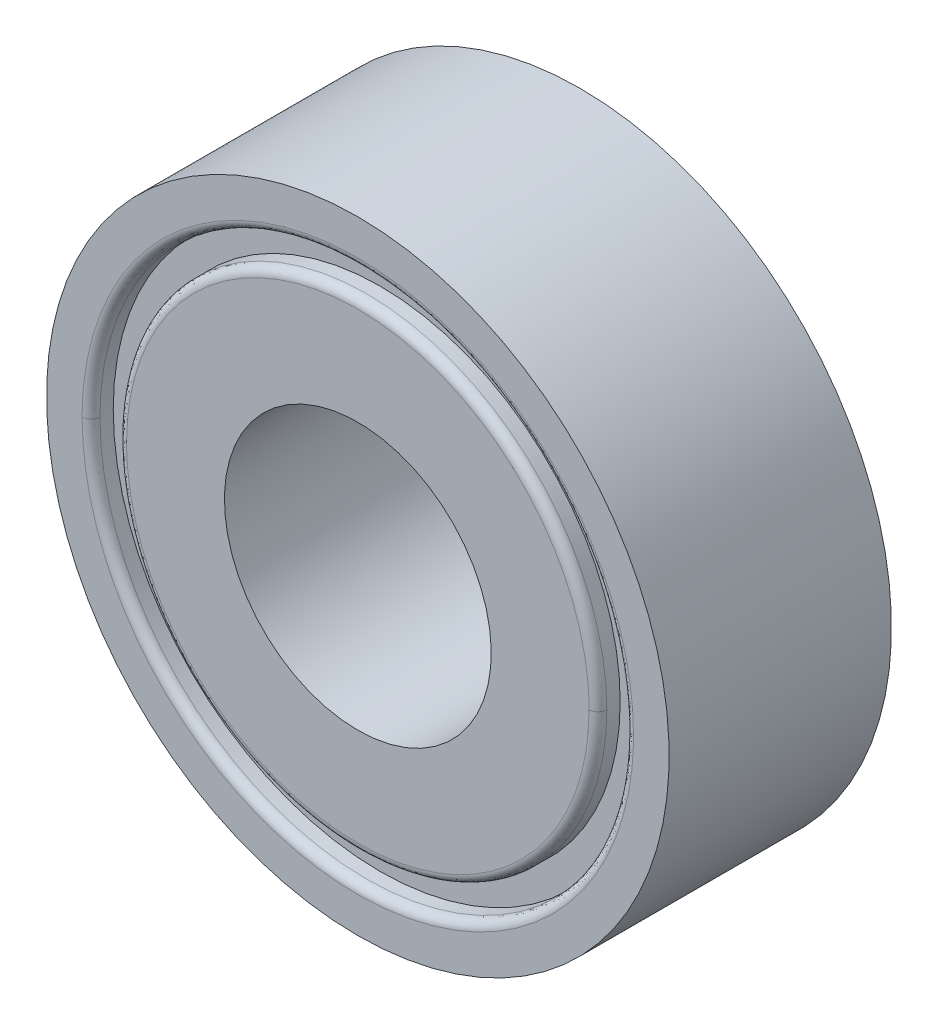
ISO-10303-21;
HEADER;
FILE_DESCRIPTION(('STEP AP214'),'2;1');
FILE_NAME('part.step','',(''),(''),'','','');
FILE_SCHEMA(('AUTOMOTIVE_DESIGN { 1 0 10303 214 1 1 1 1 }'));
ENDSEC;
DATA;
#1=APPLICATION_CONTEXT('core data for automotive mechanical design processes');
#2=APPLICATION_PROTOCOL_DEFINITION('international standard','automotive_design',2000,#1);
#3=PRODUCT_CONTEXT('',#1,'mechanical');
#4=PRODUCT('Part','Part','',(#3));
#5=PRODUCT_RELATED_PRODUCT_CATEGORY('part','',(#4));
#6=PRODUCT_DEFINITION_FORMATION('','',#4);
#7=PRODUCT_DEFINITION_CONTEXT('part definition',#1,'design');
#8=PRODUCT_DEFINITION('design','',#6,#7);
#9=PRODUCT_DEFINITION_SHAPE('','',#8);
#10=(LENGTH_UNIT() NAMED_UNIT(*) SI_UNIT(.MILLI.,.METRE.));
#11=(NAMED_UNIT(*) PLANE_ANGLE_UNIT() SI_UNIT($,.RADIAN.));
#12=(NAMED_UNIT(*) SI_UNIT($,.STERADIAN.) SOLID_ANGLE_UNIT());
#13=UNCERTAINTY_MEASURE_WITH_UNIT(LENGTH_MEASURE(1.E-05),#10,'distance_accuracy_value','');
#14=(GEOMETRIC_REPRESENTATION_CONTEXT(3) GLOBAL_UNCERTAINTY_ASSIGNED_CONTEXT((#13)) GLOBAL_UNIT_ASSIGNED_CONTEXT((#10,
#11,#12)) REPRESENTATION_CONTEXT('',''));
#15=CARTESIAN_POINT('',(0.,0.,0.));
#16=DIRECTION('',(0.,0.,1.));
#17=DIRECTION('',(1.,0.,0.));
#18=AXIS2_PLACEMENT_3D('',#15,#16,#17);
#19=CARTESIAN_POINT('',(-3.000499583,0.,8.890016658));
#20=CARTESIAN_POINT('',(-3.000499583,-6.000999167,8.890016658));
#21=CARTESIAN_POINT('',(3.000499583,-6.000999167,8.890016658));
#22=CARTESIAN_POINT('',(3.000499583,0.,8.890016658));
#23=CARTESIAN_POINT('',(-2.993677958,0.,8.958005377));
#24=CARTESIAN_POINT('',(-2.993677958,-5.987355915,8.958005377));
#25=CARTESIAN_POINT('',(2.993677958,-5.987355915,8.958005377));
#26=CARTESIAN_POINT('',(2.993677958,0.,8.958005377));
#27=CARTESIAN_POINT('',(-3.041994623,0.,9.006322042));
#28=CARTESIAN_POINT('',(-3.041994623,-6.083989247,9.006322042));
#29=CARTESIAN_POINT('',(3.041994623,-6.083989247,9.006322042));
#30=CARTESIAN_POINT('',(3.041994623,0.,9.006322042));
#31=CARTESIAN_POINT('',(-3.109983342,0.,8.999500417));
#32=CARTESIAN_POINT('',(-3.109983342,-6.219966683,8.999500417));
#33=CARTESIAN_POINT('',(3.109983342,-6.219966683,8.999500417));
#34=CARTESIAN_POINT('',(3.109983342,0.,8.999500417));
#35=(BOUNDED_SURFACE() B_SPLINE_SURFACE(3,3,((#19,#20,#21,#22),(#23,#24,#25,#26),(#27,#28,#29,
#30),(#31,#32,#33,#34)),.UNSPECIFIED.,.F.,.F.,.F.) B_SPLINE_SURFACE_WITH_KNOTS((4,4),(4,4),(0.,
1.),(0.,1.),.UNSPECIFIED.) GEOMETRIC_REPRESENTATION_ITEM() RATIONAL_B_SPLINE_SURFACE(((1.,
0.333333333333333,0.333333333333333,1.),(0.755320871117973,0.251773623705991,0.251773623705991,
0.755320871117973),(0.755320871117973,0.251773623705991,0.251773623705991,0.755320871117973),
(1.,0.333333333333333,0.333333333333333,1.))) REPRESENTATION_ITEM('') SURFACE());
#36=CARTESIAN_POINT('',(3.000499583,0.,8.890016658));
#37=CARTESIAN_POINT('',(2.993677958,0.,8.958005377));
#38=CARTESIAN_POINT('',(3.041994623,0.,9.006322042));
#39=CARTESIAN_POINT('',(3.109983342,0.,8.999500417));
#40=(BOUNDED_CURVE() B_SPLINE_CURVE(3,(#36,#37,#38,#39),.UNSPECIFIED.,.F.,
.F.) B_SPLINE_CURVE_WITH_KNOTS((4,4),(0.,1.),
.UNSPECIFIED.) CURVE() GEOMETRIC_REPRESENTATION_ITEM() RATIONAL_B_SPLINE_CURVE((1.,
0.755320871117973,0.755320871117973,1.)) REPRESENTATION_ITEM(''));
#41=CARTESIAN_POINT('',(2.99999999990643,-4.04071327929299E-10,8.89999999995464));
#42=VERTEX_POINT('',#41);
#43=CARTESIAN_POINT('',(3.09999999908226,0.,9.00000000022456));
#44=VERTEX_POINT('',#43);
#45=EDGE_CURVE('E92',#42,#44,#40,.T.);
#46=CARTESIAN_POINT('',(0.,0.,8.9));
#47=DIRECTION('',(0.,0.,1.));
#48=DIRECTION('',(1.,0.,0.));
#49=AXIS2_PLACEMENT_3D('',#46,#47,#48);
#50=CIRCLE('',#49,3.);
#51=CARTESIAN_POINT('',(-2.99999999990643,-9.2296542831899E-10,8.89999999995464));
#52=VERTEX_POINT('',#51);
#53=EDGE_CURVE('E97',#52,#42,#50,.T.);
#54=CARTESIAN_POINT('',(-3.000499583,0.,8.890016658));
#55=CARTESIAN_POINT('',(-2.993677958,0.,8.958005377));
#56=CARTESIAN_POINT('',(-3.041994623,0.,9.006322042));
#57=CARTESIAN_POINT('',(-3.109983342,0.,8.999500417));
#58=(BOUNDED_CURVE() B_SPLINE_CURVE(3,(#54,#55,#56,#57),.UNSPECIFIED.,.F.,
.F.) B_SPLINE_CURVE_WITH_KNOTS((4,4),(0.,1.),
.UNSPECIFIED.) CURVE() GEOMETRIC_REPRESENTATION_ITEM() RATIONAL_B_SPLINE_CURVE((1.,
0.755320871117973,0.755320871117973,1.)) REPRESENTATION_ITEM(''));
#59=CARTESIAN_POINT('',(-3.09999999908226,0.,9.00000000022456));
#60=VERTEX_POINT('',#59);
#61=EDGE_CURVE('E80',#60,#52,#58,.F.);
#62=CARTESIAN_POINT('',(-3.10000000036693,0.,9.00000000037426));
#63=CARTESIAN_POINT('',(-3.10000000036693,-6.19999999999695,9.00000000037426));
#64=CARTESIAN_POINT('',(3.10000000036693,-6.19999999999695,9.00000000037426));
#65=CARTESIAN_POINT('',(3.10000000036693,0.,9.00000000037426));
#66=(BOUNDED_CURVE() B_SPLINE_CURVE(3,(#62,#63,#64,#65),.UNSPECIFIED.,.F.,
.F.) B_SPLINE_CURVE_WITH_KNOTS((4,4),(0.,1.),
.UNSPECIFIED.) CURVE() GEOMETRIC_REPRESENTATION_ITEM() RATIONAL_B_SPLINE_CURVE((0.956578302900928,
0.318859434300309,0.318859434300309,0.956578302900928)) REPRESENTATION_ITEM(''));
#67=EDGE_CURVE('E99',#44,#60,#66,.F.);
#68=ORIENTED_EDGE('',*,*,#45,.F.);
#69=ORIENTED_EDGE('',*,*,#53,.F.);
#70=ORIENTED_EDGE('',*,*,#61,.F.);
#71=ORIENTED_EDGE('',*,*,#67,.F.);
#72=EDGE_LOOP('',(#68,#69,#70,#71));
#73=FACE_BOUND('',#72,.T.);
#74=ADVANCED_FACE('F16',(#73),#35,.T.);
#75=CARTESIAN_POINT('',(3.000499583,0.,8.890016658));
#76=CARTESIAN_POINT('',(3.000499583,6.000999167,8.890016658));
#77=CARTESIAN_POINT('',(-3.000499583,6.000999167,8.890016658));
#78=CARTESIAN_POINT('',(-3.000499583,0.,8.890016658));
#79=CARTESIAN_POINT('',(2.993677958,0.,8.958005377));
#80=CARTESIAN_POINT('',(2.993677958,5.987355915,8.958005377));
#81=CARTESIAN_POINT('',(-2.993677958,5.987355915,8.958005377));
#82=CARTESIAN_POINT('',(-2.993677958,0.,8.958005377));
#83=CARTESIAN_POINT('',(3.041994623,0.,9.006322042));
#84=CARTESIAN_POINT('',(3.041994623,6.083989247,9.006322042));
#85=CARTESIAN_POINT('',(-3.041994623,6.083989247,9.006322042));
#86=CARTESIAN_POINT('',(-3.041994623,0.,9.006322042));
#87=CARTESIAN_POINT('',(3.109983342,0.,8.999500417));
#88=CARTESIAN_POINT('',(3.109983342,6.219966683,8.999500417));
#89=CARTESIAN_POINT('',(-3.109983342,6.219966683,8.999500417));
#90=CARTESIAN_POINT('',(-3.109983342,0.,8.999500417));
#91=(BOUNDED_SURFACE() B_SPLINE_SURFACE(3,3,((#75,#76,#77,#78),(#79,#80,#81,#82),(#83,#84,#85,
#86),(#87,#88,#89,#90)),.UNSPECIFIED.,.F.,.F.,.F.) B_SPLINE_SURFACE_WITH_KNOTS((4,4),(4,4),(0.,
1.),(0.,1.),.UNSPECIFIED.) GEOMETRIC_REPRESENTATION_ITEM() RATIONAL_B_SPLINE_SURFACE(((1.,
0.333333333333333,0.333333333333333,1.),(0.755320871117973,0.251773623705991,0.251773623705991,
0.755320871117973),(0.755320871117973,0.251773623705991,0.251773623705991,0.755320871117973),
(1.,0.333333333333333,0.333333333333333,1.))) REPRESENTATION_ITEM('') SURFACE());
#92=CARTESIAN_POINT('',(0.,0.,8.9));
#93=DIRECTION('',(0.,0.,1.));
#94=DIRECTION('',(1.,0.,0.));
#95=AXIS2_PLACEMENT_3D('',#92,#93,#94);
#96=CIRCLE('',#95,3.);
#97=EDGE_CURVE('E84',#42,#52,#96,.T.);
#98=CARTESIAN_POINT('',(3.10000000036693,0.,9.00000000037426));
#99=CARTESIAN_POINT('',(3.10000000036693,6.19999999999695,9.00000000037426));
#100=CARTESIAN_POINT('',(-3.10000000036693,6.19999999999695,9.00000000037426));
#101=CARTESIAN_POINT('',(-3.10000000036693,0.,9.00000000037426));
#102=(BOUNDED_CURVE() B_SPLINE_CURVE(3,(#98,#99,#100,#101),.UNSPECIFIED.,.F.,
.F.) B_SPLINE_CURVE_WITH_KNOTS((4,4),(0.,1.),
.UNSPECIFIED.) CURVE() GEOMETRIC_REPRESENTATION_ITEM() RATIONAL_B_SPLINE_CURVE((0.956578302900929,
0.318859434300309,0.318859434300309,0.956578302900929)) REPRESENTATION_ITEM(''));
#103=EDGE_CURVE('E87',#60,#44,#102,.F.);
#104=ORIENTED_EDGE('',*,*,#97,.F.);
#105=ORIENTED_EDGE('',*,*,#45,.T.);
#106=ORIENTED_EDGE('',*,*,#103,.F.);
#107=ORIENTED_EDGE('',*,*,#61,.T.);
#108=EDGE_LOOP('',(#104,#105,#106,#107));
#109=FACE_BOUND('',#108,.T.);
#110=ADVANCED_FACE('F82',(#109),#91,.T.);
#111=CARTESIAN_POINT('',(0.,0.,8.75));
#112=DIRECTION('',(0.,0.,1.));
#113=DIRECTION('',(1.,0.,0.));
#114=AXIS2_PLACEMENT_3D('',#111,#112,#113);
#115=CYLINDRICAL_SURFACE('',#114,3.);
#116=ORIENTED_EDGE('',*,*,#97,.T.);
#117=ORIENTED_EDGE('',*,*,#53,.T.);
#118=EDGE_LOOP('',(#116,#117));
#119=FACE_BOUND('',#118,.T.);
#120=CARTESIAN_POINT('',(0.,0.,8.75));
#121=DIRECTION('',(0.,0.,1.));
#122=DIRECTION('',(1.,0.,0.));
#123=AXIS2_PLACEMENT_3D('',#120,#121,#122);
#124=CIRCLE('',#123,3.);
#125=CARTESIAN_POINT('',(3.,0.,8.75));
#126=VERTEX_POINT('',#125);
#127=EDGE_CURVE('E21',#126,#126,#124,.T.);
#128=ORIENTED_EDGE('',*,*,#127,.F.);
#129=EDGE_LOOP('',(#128));
#130=FACE_BOUND('',#129,.T.);
#131=ADVANCED_FACE('F95',(#119,#130),#115,.F.);
#132=CARTESIAN_POINT('',(-3.542,-3.542,9.));
#133=DIRECTION('',(0.,0.,1.));
#134=DIRECTION('',(1.,0.,0.));
#135=AXIS2_PLACEMENT_3D('',#132,#133,#134);
#136=PLANE('',#135);
#137=ORIENTED_EDGE('',*,*,#67,.T.);
#138=ORIENTED_EDGE('',*,*,#103,.T.);
#139=EDGE_LOOP('',(#137,#138));
#140=FACE_BOUND('',#139,.T.);
#141=CARTESIAN_POINT('',(0.,0.,9.));
#142=DIRECTION('',(0.,0.,1.));
#143=DIRECTION('',(0.,-1.,0.));
#144=AXIS2_PLACEMENT_3D('',#141,#142,#143);
#145=CIRCLE('',#144,3.5);
#146=CARTESIAN_POINT('',(0.,-3.5,9.));
#147=VERTEX_POINT('',#146);
#148=EDGE_CURVE('E235',#147,#147,#145,.T.);
#149=ORIENTED_EDGE('',*,*,#148,.T.);
#150=EDGE_LOOP('',(#149));
#151=FACE_BOUND('',#150,.T.);
#152=ADVANCED_FACE('F113',(#140,#151),#136,.T.);
#153=CARTESIAN_POINT('',(-3.036,-3.036,8.75));
#154=DIRECTION('',(0.,0.,1.));
#155=DIRECTION('',(1.,0.,0.));
#156=AXIS2_PLACEMENT_3D('',#153,#154,#155);
#157=PLANE('',#156);
#158=CARTESIAN_POINT('',(0.,0.,8.75));
#159=DIRECTION('',(0.,0.,1.));
#160=DIRECTION('',(1.,0.,0.));
#161=AXIS2_PLACEMENT_3D('',#158,#159,#160);
#162=CIRCLE('',#161,2.7);
#163=CARTESIAN_POINT('',(2.7,0.,8.75));
#164=VERTEX_POINT('',#163);
#165=EDGE_CURVE('E233',#164,#164,#162,.F.);
#166=ORIENTED_EDGE('',*,*,#165,.T.);
#167=EDGE_LOOP('',(#166));
#168=FACE_BOUND('',#167,.T.);
#169=ORIENTED_EDGE('',*,*,#127,.T.);
#170=EDGE_LOOP('',(#169));
#171=FACE_BOUND('',#170,.T.);
#172=ADVANCED_FACE('F123',(#168,#171),#157,.T.);
#173=CARTESIAN_POINT('',(0.,0.,6.5));
#174=DIRECTION('',(0.,0.,1.));
#175=DIRECTION('',(0.,-1.,0.));
#176=AXIS2_PLACEMENT_3D('',#173,#174,#175);
#177=CYLINDRICAL_SURFACE('',#176,3.5);
#178=ORIENTED_EDGE('',*,*,#148,.F.);
#179=EDGE_LOOP('',(#178));
#180=FACE_BOUND('',#179,.T.);
#181=CARTESIAN_POINT('',(0.,0.,6.5));
#182=DIRECTION('',(0.,0.,1.));
#183=DIRECTION('',(0.,-1.,0.));
#184=AXIS2_PLACEMENT_3D('',#181,#182,#183);
#185=CIRCLE('',#184,3.5);
#186=CARTESIAN_POINT('',(0.,-3.5,6.5));
#187=VERTEX_POINT('',#186);
#188=EDGE_CURVE('E229',#187,#187,#185,.T.);
#189=ORIENTED_EDGE('',*,*,#188,.T.);
#190=EDGE_LOOP('',(#189));
#191=FACE_BOUND('',#190,.T.);
#192=ADVANCED_FACE('F438',(#180,#191),#177,.T.);
#193=CARTESIAN_POINT('',(0.,0.,8.75));
#194=DIRECTION('',(0.,0.,1.));
#195=DIRECTION('',(1.,0.,0.));
#196=AXIS2_PLACEMENT_3D('',#193,#194,#195);
#197=CYLINDRICAL_SURFACE('',#196,2.7);
#198=ORIENTED_EDGE('',*,*,#165,.F.);
#199=EDGE_LOOP('',(#198));
#200=FACE_BOUND('',#199,.T.);
#201=CARTESIAN_POINT('',(0.,0.,8.89999999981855));
#202=DIRECTION('',(0.,0.,1.));
#203=DIRECTION('',(0.,-1.,0.));
#204=AXIS2_PLACEMENT_3D('',#201,#202,#203);
#205=CIRCLE('',#204,2.70000000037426);
#206=CARTESIAN_POINT('',(2.7000000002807,-1.2122139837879E-10,8.89999999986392));
#207=VERTEX_POINT('',#206);
#208=CARTESIAN_POINT('',(-2.7000000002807,-2.76889628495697E-10,8.89999999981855));
#209=VERTEX_POINT('',#208);
#210=EDGE_CURVE('E232',#207,#209,#205,.T.);
#211=ORIENTED_EDGE('',*,*,#210,.F.);
#212=CARTESIAN_POINT('',(0.,0.,8.89999999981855));
#213=DIRECTION('',(0.,0.,1.));
#214=DIRECTION('',(0.,-1.,0.));
#215=AXIS2_PLACEMENT_3D('',#212,#213,#214);
#216=CIRCLE('',#215,2.70000000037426);
#217=EDGE_CURVE('E350',#209,#207,#216,.T.);
#218=ORIENTED_EDGE('',*,*,#217,.F.);
#219=EDGE_LOOP('',(#211,#218));
#220=FACE_BOUND('',#219,.T.);
#221=ADVANCED_FACE('F158',(#200,#220),#197,.T.);
#222=CARTESIAN_POINT('',(-3.542,-3.542,6.5));
#223=DIRECTION('',(0.,0.,1.));
#224=DIRECTION('',(1.,0.,0.));
#225=AXIS2_PLACEMENT_3D('',#222,#223,#224);
#226=PLANE('',#225);
#227=CARTESIAN_POINT('',(3.10000000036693,0.,6.49999999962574));
#228=CARTESIAN_POINT('',(3.10000000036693,-6.19999999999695,6.49999999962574));
#229=CARTESIAN_POINT('',(-3.10000000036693,-6.19999999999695,6.49999999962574));
#230=CARTESIAN_POINT('',(-3.10000000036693,0.,6.49999999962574));
#231=(BOUNDED_CURVE() B_SPLINE_CURVE(3,(#227,#228,#229,#230),.UNSPECIFIED.,.F.,
.F.) B_SPLINE_CURVE_WITH_KNOTS((4,4),(0.,1.),
.UNSPECIFIED.) CURVE() GEOMETRIC_REPRESENTATION_ITEM() RATIONAL_B_SPLINE_CURVE((0.956578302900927,
0.318859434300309,0.318859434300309,0.956578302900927)) REPRESENTATION_ITEM(''));
#232=CARTESIAN_POINT('',(3.09999999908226,0.,6.49999999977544));
#233=VERTEX_POINT('',#232);
#234=CARTESIAN_POINT('',(-3.09999999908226,0.,6.49999999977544));
#235=VERTEX_POINT('',#234);
#236=EDGE_CURVE('E142',#233,#235,#231,.T.);
#237=ORIENTED_EDGE('',*,*,#236,.F.);
#238=CARTESIAN_POINT('',(-3.10000000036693,0.,6.49999999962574));
#239=CARTESIAN_POINT('',(-3.10000000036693,6.19999999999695,6.49999999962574));
#240=CARTESIAN_POINT('',(3.10000000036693,6.19999999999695,6.49999999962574));
#241=CARTESIAN_POINT('',(3.10000000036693,0.,6.49999999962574));
#242=(BOUNDED_CURVE() B_SPLINE_CURVE(3,(#238,#239,#240,#241),.UNSPECIFIED.,.F.,
.F.) B_SPLINE_CURVE_WITH_KNOTS((4,4),(0.,1.),
.UNSPECIFIED.) CURVE() GEOMETRIC_REPRESENTATION_ITEM() RATIONAL_B_SPLINE_CURVE((0.956578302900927,
0.318859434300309,0.318859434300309,0.956578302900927)) REPRESENTATION_ITEM(''));
#243=EDGE_CURVE('E337',#235,#233,#242,.T.);
#244=ORIENTED_EDGE('',*,*,#243,.F.);
#245=EDGE_LOOP('',(#237,#244));
#246=FACE_BOUND('',#245,.T.);
#247=ORIENTED_EDGE('',*,*,#188,.F.);
#248=EDGE_LOOP('',(#247));
#249=FACE_BOUND('',#248,.T.);
#250=ADVANCED_FACE('F148',(#246,#249),#226,.F.);
#251=CARTESIAN_POINT('',(2.590016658,0.,8.999500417));
#252=CARTESIAN_POINT('',(2.590016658,5.180033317,8.999500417));
#253=CARTESIAN_POINT('',(-2.590016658,5.180033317,8.999500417));
#254=CARTESIAN_POINT('',(-2.590016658,0.,8.999500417));
#255=CARTESIAN_POINT('',(2.658005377,0.,9.006322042));
#256=CARTESIAN_POINT('',(2.658005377,5.316010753,9.006322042));
#257=CARTESIAN_POINT('',(-2.658005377,5.316010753,9.006322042));
#258=CARTESIAN_POINT('',(-2.658005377,0.,9.006322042));
#259=CARTESIAN_POINT('',(2.706322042,0.,8.958005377));
#260=CARTESIAN_POINT('',(2.706322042,5.412644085,8.958005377));
#261=CARTESIAN_POINT('',(-2.706322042,5.412644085,8.958005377));
#262=CARTESIAN_POINT('',(-2.706322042,0.,8.958005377));
#263=CARTESIAN_POINT('',(2.699500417,0.,8.890016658));
#264=CARTESIAN_POINT('',(2.699500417,5.399000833,8.890016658));
#265=CARTESIAN_POINT('',(-2.699500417,5.399000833,8.890016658));
#266=CARTESIAN_POINT('',(-2.699500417,0.,8.890016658));
#267=(BOUNDED_SURFACE() B_SPLINE_SURFACE(3,3,((#251,#252,#253,#254),(#255,#256,#257,#258),(#259,
#260,#261,#262),(#263,#264,#265,#266)),.UNSPECIFIED.,.F.,.F.,
.F.) B_SPLINE_SURFACE_WITH_KNOTS((4,4),(4,4),(0.,1.),(0.,1.),
.UNSPECIFIED.) GEOMETRIC_REPRESENTATION_ITEM() RATIONAL_B_SPLINE_SURFACE(((1.,0.333333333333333,
0.333333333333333,1.),(0.755320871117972,0.251773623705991,0.251773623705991,0.755320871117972),
(0.755320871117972,0.251773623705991,0.251773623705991,0.755320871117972),(1.,0.333333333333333,
0.333333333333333,1.))) REPRESENTATION_ITEM('') SURFACE());
#268=CARTESIAN_POINT('',(-2.59999999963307,0.,9.00000000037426));
#269=CARTESIAN_POINT('',(-2.59999999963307,5.20000000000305,9.00000000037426));
#270=CARTESIAN_POINT('',(2.59999999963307,5.20000000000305,9.00000000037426));
#271=CARTESIAN_POINT('',(2.59999999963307,0.,9.00000000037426));
#272=(BOUNDED_CURVE() B_SPLINE_CURVE(3,(#268,#269,#270,#271),.UNSPECIFIED.,.F.,
.F.) B_SPLINE_CURVE_WITH_KNOTS((4,4),(0.,1.),
.UNSPECIFIED.) CURVE() GEOMETRIC_REPRESENTATION_ITEM() RATIONAL_B_SPLINE_CURVE((0.95657830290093,
0.31885943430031,0.31885943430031,0.95657830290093)) REPRESENTATION_ITEM(''));
#273=CARTESIAN_POINT('',(2.5999999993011,0.,9.00000000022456));
#274=VERTEX_POINT('',#273);
#275=CARTESIAN_POINT('',(-2.5999999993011,0.,9.00000000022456));
#276=VERTEX_POINT('',#275);
#277=EDGE_CURVE('E174',#274,#276,#272,.F.);
#278=CARTESIAN_POINT('',(2.590016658,0.,8.999500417));
#279=CARTESIAN_POINT('',(2.658005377,0.,9.006322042));
#280=CARTESIAN_POINT('',(2.706322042,0.,8.958005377));
#281=CARTESIAN_POINT('',(2.699500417,0.,8.890016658));
#282=(BOUNDED_CURVE() B_SPLINE_CURVE(3,(#278,#279,#280,#281),.UNSPECIFIED.,.F.,
.F.) B_SPLINE_CURVE_WITH_KNOTS((4,4),(0.,1.),
.UNSPECIFIED.) CURVE() GEOMETRIC_REPRESENTATION_ITEM() RATIONAL_B_SPLINE_CURVE((1.,
0.755320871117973,0.755320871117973,1.)) REPRESENTATION_ITEM(''));
#283=EDGE_CURVE('E353',#207,#274,#282,.F.);
#284=CARTESIAN_POINT('',(-2.590016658,0.,8.999500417));
#285=CARTESIAN_POINT('',(-2.658005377,0.,9.006322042));
#286=CARTESIAN_POINT('',(-2.706322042,0.,8.958005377));
#287=CARTESIAN_POINT('',(-2.699500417,0.,8.890016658));
#288=(BOUNDED_CURVE() B_SPLINE_CURVE(3,(#284,#285,#286,#287),.UNSPECIFIED.,.F.,
.F.) B_SPLINE_CURVE_WITH_KNOTS((4,4),(0.,1.),
.UNSPECIFIED.) CURVE() GEOMETRIC_REPRESENTATION_ITEM() RATIONAL_B_SPLINE_CURVE((1.,
0.755320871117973,0.755320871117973,1.)) REPRESENTATION_ITEM(''));
#289=EDGE_CURVE('E347',#276,#209,#288,.T.);
#290=ORIENTED_EDGE('',*,*,#277,.F.);
#291=ORIENTED_EDGE('',*,*,#283,.F.);
#292=ORIENTED_EDGE('',*,*,#210,.T.);
#293=ORIENTED_EDGE('',*,*,#289,.F.);
#294=EDGE_LOOP('',(#290,#291,#292,#293));
#295=FACE_BOUND('',#294,.T.);
#296=ADVANCED_FACE('F157',(#295),#267,.T.);
#297=CARTESIAN_POINT('',(-2.590016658,0.,8.999500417));
#298=CARTESIAN_POINT('',(-2.590016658,-5.180033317,8.999500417));
#299=CARTESIAN_POINT('',(2.590016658,-5.180033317,8.999500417));
#300=CARTESIAN_POINT('',(2.590016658,0.,8.999500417));
#301=CARTESIAN_POINT('',(-2.658005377,0.,9.006322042));
#302=CARTESIAN_POINT('',(-2.658005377,-5.316010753,9.006322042));
#303=CARTESIAN_POINT('',(2.658005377,-5.316010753,9.006322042));
#304=CARTESIAN_POINT('',(2.658005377,0.,9.006322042));
#305=CARTESIAN_POINT('',(-2.706322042,0.,8.958005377));
#306=CARTESIAN_POINT('',(-2.706322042,-5.412644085,8.958005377));
#307=CARTESIAN_POINT('',(2.706322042,-5.412644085,8.958005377));
#308=CARTESIAN_POINT('',(2.706322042,0.,8.958005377));
#309=CARTESIAN_POINT('',(-2.699500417,0.,8.890016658));
#310=CARTESIAN_POINT('',(-2.699500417,-5.399000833,8.890016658));
#311=CARTESIAN_POINT('',(2.699500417,-5.399000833,8.890016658));
#312=CARTESIAN_POINT('',(2.699500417,0.,8.890016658));
#313=(BOUNDED_SURFACE() B_SPLINE_SURFACE(3,3,((#297,#298,#299,#300),(#301,#302,#303,#304),(#305,
#306,#307,#308),(#309,#310,#311,#312)),.UNSPECIFIED.,.F.,.F.,
.F.) B_SPLINE_SURFACE_WITH_KNOTS((4,4),(4,4),(0.,1.),(0.,1.),
.UNSPECIFIED.) GEOMETRIC_REPRESENTATION_ITEM() RATIONAL_B_SPLINE_SURFACE(((1.,0.333333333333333,
0.333333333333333,1.),(0.755320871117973,0.251773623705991,0.251773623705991,0.755320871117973),
(0.755320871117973,0.251773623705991,0.251773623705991,0.755320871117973),(1.,0.333333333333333,
0.333333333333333,1.))) REPRESENTATION_ITEM('') SURFACE());
#314=CARTESIAN_POINT('',(2.59999999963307,0.,9.00000000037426));
#315=CARTESIAN_POINT('',(2.59999999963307,-5.20000000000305,9.00000000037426));
#316=CARTESIAN_POINT('',(-2.59999999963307,-5.20000000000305,9.00000000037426));
#317=CARTESIAN_POINT('',(-2.59999999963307,0.,9.00000000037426));
#318=(BOUNDED_CURVE() B_SPLINE_CURVE(3,(#314,#315,#316,#317),.UNSPECIFIED.,.F.,
.F.) B_SPLINE_CURVE_WITH_KNOTS((4,4),(0.,1.),
.UNSPECIFIED.) CURVE() GEOMETRIC_REPRESENTATION_ITEM() RATIONAL_B_SPLINE_CURVE((0.956578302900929,
0.31885943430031,0.31885943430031,0.956578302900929)) REPRESENTATION_ITEM(''));
#319=EDGE_CURVE('E185',#276,#274,#318,.F.);
#320=ORIENTED_EDGE('',*,*,#283,.T.);
#321=ORIENTED_EDGE('',*,*,#319,.F.);
#322=ORIENTED_EDGE('',*,*,#289,.T.);
#323=ORIENTED_EDGE('',*,*,#217,.T.);
#324=EDGE_LOOP('',(#320,#321,#322,#323));
#325=FACE_BOUND('',#324,.T.);
#326=ADVANCED_FACE('F428',(#325),#313,.T.);
#327=CARTESIAN_POINT('',(3.109983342,0.,6.500499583));
#328=CARTESIAN_POINT('',(3.109983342,6.219966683,6.500499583));
#329=CARTESIAN_POINT('',(-3.109983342,6.219966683,6.500499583));
#330=CARTESIAN_POINT('',(-3.109983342,0.,6.500499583));
#331=CARTESIAN_POINT('',(3.041994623,0.,6.493677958));
#332=CARTESIAN_POINT('',(3.041994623,6.083989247,6.493677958));
#333=CARTESIAN_POINT('',(-3.041994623,6.083989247,6.493677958));
#334=CARTESIAN_POINT('',(-3.041994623,0.,6.493677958));
#335=CARTESIAN_POINT('',(2.993677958,0.,6.541994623));
#336=CARTESIAN_POINT('',(2.993677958,5.987355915,6.541994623));
#337=CARTESIAN_POINT('',(-2.993677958,5.987355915,6.541994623));
#338=CARTESIAN_POINT('',(-2.993677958,0.,6.541994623));
#339=CARTESIAN_POINT('',(3.000499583,0.,6.609983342));
#340=CARTESIAN_POINT('',(3.000499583,6.000999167,6.609983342));
#341=CARTESIAN_POINT('',(-3.000499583,6.000999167,6.609983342));
#342=CARTESIAN_POINT('',(-3.000499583,0.,6.609983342));
#343=(BOUNDED_SURFACE() B_SPLINE_SURFACE(3,3,((#327,#328,#329,#330),(#331,#332,#333,#334),(#335,
#336,#337,#338),(#339,#340,#341,#342)),.UNSPECIFIED.,.F.,.F.,
.F.) B_SPLINE_SURFACE_WITH_KNOTS((4,4),(4,4),(0.,1.),(0.,1.),
.UNSPECIFIED.) GEOMETRIC_REPRESENTATION_ITEM() RATIONAL_B_SPLINE_SURFACE(((1.,0.333333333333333,
0.333333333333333,1.),(0.755320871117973,0.251773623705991,0.251773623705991,0.755320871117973),
(0.755320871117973,0.251773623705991,0.251773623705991,0.755320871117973),(1.,0.333333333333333,
0.333333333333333,1.))) REPRESENTATION_ITEM('') SURFACE());
#344=CARTESIAN_POINT('',(3.109983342,0.,6.500499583));
#345=CARTESIAN_POINT('',(3.041994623,0.,6.493677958));
#346=CARTESIAN_POINT('',(2.993677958,0.,6.541994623));
#347=CARTESIAN_POINT('',(3.000499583,0.,6.609983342));
#348=(BOUNDED_CURVE() B_SPLINE_CURVE(3,(#344,#345,#346,#347),.UNSPECIFIED.,.F.,
.F.) B_SPLINE_CURVE_WITH_KNOTS((4,4),(0.,1.),
.UNSPECIFIED.) CURVE() GEOMETRIC_REPRESENTATION_ITEM() RATIONAL_B_SPLINE_CURVE((1.,
0.755320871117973,0.755320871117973,1.)) REPRESENTATION_ITEM(''));
#349=CARTESIAN_POINT('',(2.99999999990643,-9.2296542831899E-10,6.6));
#350=VERTEX_POINT('',#349);
#351=EDGE_CURVE('E468',#350,#233,#348,.F.);
#352=CARTESIAN_POINT('',(0.,0.,6.6));
#353=DIRECTION('',(0.,0.,-1.));
#354=DIRECTION('',(-1.,0.,0.));
#355=AXIS2_PLACEMENT_3D('',#352,#353,#354);
#356=CIRCLE('',#355,3.);
#357=CARTESIAN_POINT('',(-2.99999999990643,-4.04071327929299E-10,6.60000000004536));
#358=VERTEX_POINT('',#357);
#359=EDGE_CURVE('E454',#358,#350,#356,.T.);
#360=CARTESIAN_POINT('',(-3.109983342,0.,6.500499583));
#361=CARTESIAN_POINT('',(-3.041994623,0.,6.493677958));
#362=CARTESIAN_POINT('',(-2.993677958,0.,6.541994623));
#363=CARTESIAN_POINT('',(-3.000499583,0.,6.609983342));
#364=(BOUNDED_CURVE() B_SPLINE_CURVE(3,(#360,#361,#362,#363),.UNSPECIFIED.,.F.,
.F.) B_SPLINE_CURVE_WITH_KNOTS((4,4),(0.,1.),
.UNSPECIFIED.) CURVE() GEOMETRIC_REPRESENTATION_ITEM() RATIONAL_B_SPLINE_CURVE((1.,
0.755320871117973,0.755320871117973,1.)) REPRESENTATION_ITEM(''));
#365=EDGE_CURVE('E473',#235,#358,#364,.T.);
#366=ORIENTED_EDGE('',*,*,#243,.T.);
#367=ORIENTED_EDGE('',*,*,#351,.F.);
#368=ORIENTED_EDGE('',*,*,#359,.F.);
#369=ORIENTED_EDGE('',*,*,#365,.F.);
#370=EDGE_LOOP('',(#366,#367,#368,#369));
#371=FACE_BOUND('',#370,.T.);
#372=ADVANCED_FACE('F312',(#371),#343,.T.);
#373=CARTESIAN_POINT('',(-3.109983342,0.,6.500499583));
#374=CARTESIAN_POINT('',(-3.109983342,-6.219966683,6.500499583));
#375=CARTESIAN_POINT('',(3.109983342,-6.219966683,6.500499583));
#376=CARTESIAN_POINT('',(3.109983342,0.,6.500499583));
#377=CARTESIAN_POINT('',(-3.041994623,0.,6.493677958));
#378=CARTESIAN_POINT('',(-3.041994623,-6.083989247,6.493677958));
#379=CARTESIAN_POINT('',(3.041994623,-6.083989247,6.493677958));
#380=CARTESIAN_POINT('',(3.041994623,0.,6.493677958));
#381=CARTESIAN_POINT('',(-2.993677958,0.,6.541994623));
#382=CARTESIAN_POINT('',(-2.993677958,-5.987355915,6.541994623));
#383=CARTESIAN_POINT('',(2.993677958,-5.987355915,6.541994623));
#384=CARTESIAN_POINT('',(2.993677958,0.,6.541994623));
#385=CARTESIAN_POINT('',(-3.000499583,0.,6.609983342));
#386=CARTESIAN_POINT('',(-3.000499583,-6.000999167,6.609983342));
#387=CARTESIAN_POINT('',(3.000499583,-6.000999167,6.609983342));
#388=CARTESIAN_POINT('',(3.000499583,0.,6.609983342));
#389=(BOUNDED_SURFACE() B_SPLINE_SURFACE(3,3,((#373,#374,#375,#376),(#377,#378,#379,#380),(#381,
#382,#383,#384),(#385,#386,#387,#388)),.UNSPECIFIED.,.F.,.F.,
.F.) B_SPLINE_SURFACE_WITH_KNOTS((4,4),(4,4),(0.,1.),(0.,1.),
.UNSPECIFIED.) GEOMETRIC_REPRESENTATION_ITEM() RATIONAL_B_SPLINE_SURFACE(((1.,0.333333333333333,
0.333333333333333,1.),(0.755320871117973,0.251773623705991,0.251773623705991,0.755320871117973),
(0.755320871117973,0.251773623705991,0.251773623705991,0.755320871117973),(1.,0.333333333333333,
0.333333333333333,1.))) REPRESENTATION_ITEM('') SURFACE());
#390=CARTESIAN_POINT('',(0.,0.,6.6));
#391=DIRECTION('',(0.,0.,-1.));
#392=DIRECTION('',(-1.,0.,0.));
#393=AXIS2_PLACEMENT_3D('',#390,#391,#392);
#394=CIRCLE('',#393,3.);
#395=EDGE_CURVE('E485',#350,#358,#394,.T.);
#396=ORIENTED_EDGE('',*,*,#351,.T.);
#397=ORIENTED_EDGE('',*,*,#236,.T.);
#398=ORIENTED_EDGE('',*,*,#365,.T.);
#399=ORIENTED_EDGE('',*,*,#395,.F.);
#400=EDGE_LOOP('',(#396,#397,#398,#399));
#401=FACE_BOUND('',#400,.T.);
#402=ADVANCED_FACE('F306',(#401),#389,.T.);
#403=CARTESIAN_POINT('',(-2.6312,-2.6312,9.));
#404=DIRECTION('',(0.,0.,1.));
#405=DIRECTION('',(1.,0.,0.));
#406=AXIS2_PLACEMENT_3D('',#403,#404,#405);
#407=PLANE('',#406);
#408=CARTESIAN_POINT('',(0.,0.,9.));
#409=DIRECTION('',(0.,0.,1.));
#410=DIRECTION('',(0.,-1.,0.));
#411=AXIS2_PLACEMENT_3D('',#408,#409,#410);
#412=CIRCLE('',#411,1.5);
#413=CARTESIAN_POINT('',(0.,-1.5,9.));
#414=VERTEX_POINT('',#413);
#415=EDGE_CURVE('E225',#414,#414,#412,.T.);
#416=ORIENTED_EDGE('',*,*,#415,.F.);
#417=EDGE_LOOP('',(#416));
#418=FACE_BOUND('',#417,.T.);
#419=ORIENTED_EDGE('',*,*,#277,.T.);
#420=ORIENTED_EDGE('',*,*,#319,.T.);
#421=EDGE_LOOP('',(#419,#420));
#422=FACE_BOUND('',#421,.T.);
#423=ADVANCED_FACE('F159',(#418,#422),#407,.T.);
#424=CARTESIAN_POINT('',(0.,0.,6.75));
#425=DIRECTION('',(0.,0.,-1.));
#426=DIRECTION('',(0.,1.,0.));
#427=AXIS2_PLACEMENT_3D('',#424,#425,#426);
#428=CYLINDRICAL_SURFACE('',#427,3.);
#429=ORIENTED_EDGE('',*,*,#359,.T.);
#430=ORIENTED_EDGE('',*,*,#395,.T.);
#431=EDGE_LOOP('',(#429,#430));
#432=FACE_BOUND('',#431,.T.);
#433=CARTESIAN_POINT('',(0.,0.,6.75));
#434=DIRECTION('',(0.,0.,-1.));
#435=DIRECTION('',(0.,1.,0.));
#436=AXIS2_PLACEMENT_3D('',#433,#434,#435);
#437=CIRCLE('',#436,3.);
#438=CARTESIAN_POINT('',(0.,3.,6.75));
#439=VERTEX_POINT('',#438);
#440=EDGE_CURVE('E222',#439,#439,#437,.F.);
#441=ORIENTED_EDGE('',*,*,#440,.T.);
#442=EDGE_LOOP('',(#441));
#443=FACE_BOUND('',#442,.T.);
#444=ADVANCED_FACE('F297',(#432,#443),#428,.F.);
#445=CARTESIAN_POINT('',(-2.699500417,0.,6.609983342));
#446=CARTESIAN_POINT('',(-2.699500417,-5.399000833,6.609983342));
#447=CARTESIAN_POINT('',(2.699500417,-5.399000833,6.609983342));
#448=CARTESIAN_POINT('',(2.699500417,0.,6.609983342));
#449=CARTESIAN_POINT('',(-2.706322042,0.,6.541994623));
#450=CARTESIAN_POINT('',(-2.706322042,-5.412644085,6.541994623));
#451=CARTESIAN_POINT('',(2.706322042,-5.412644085,6.541994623));
#452=CARTESIAN_POINT('',(2.706322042,0.,6.541994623));
#453=CARTESIAN_POINT('',(-2.658005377,0.,6.493677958));
#454=CARTESIAN_POINT('',(-2.658005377,-5.316010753,6.493677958));
#455=CARTESIAN_POINT('',(2.658005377,-5.316010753,6.493677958));
#456=CARTESIAN_POINT('',(2.658005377,0.,6.493677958));
#457=CARTESIAN_POINT('',(-2.590016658,0.,6.500499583));
#458=CARTESIAN_POINT('',(-2.590016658,-5.180033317,6.500499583));
#459=CARTESIAN_POINT('',(2.590016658,-5.180033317,6.500499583));
#460=CARTESIAN_POINT('',(2.590016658,0.,6.500499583));
#461=(BOUNDED_SURFACE() B_SPLINE_SURFACE(3,3,((#445,#446,#447,#448),(#449,#450,#451,#452),(#453,
#454,#455,#456),(#457,#458,#459,#460)),.UNSPECIFIED.,.F.,.F.,
.F.) B_SPLINE_SURFACE_WITH_KNOTS((4,4),(4,4),(0.,1.),(0.,1.),
.UNSPECIFIED.) GEOMETRIC_REPRESENTATION_ITEM() RATIONAL_B_SPLINE_SURFACE(((1.,0.333333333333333,
0.333333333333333,1.),(0.755320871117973,0.251773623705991,0.251773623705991,0.755320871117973),
(0.755320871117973,0.251773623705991,0.251773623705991,0.755320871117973),(1.,0.333333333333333,
0.333333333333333,1.))) REPRESENTATION_ITEM('') SURFACE());
#462=CARTESIAN_POINT('',(2.699500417,0.,6.609983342));
#463=CARTESIAN_POINT('',(2.706322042,0.,6.541994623));
#464=CARTESIAN_POINT('',(2.658005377,0.,6.493677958));
#465=CARTESIAN_POINT('',(2.590016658,0.,6.500499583));
#466=(BOUNDED_CURVE() B_SPLINE_CURVE(3,(#462,#463,#464,#465),.UNSPECIFIED.,.F.,
.F.) B_SPLINE_CURVE_WITH_KNOTS((4,4),(0.,1.),
.UNSPECIFIED.) CURVE() GEOMETRIC_REPRESENTATION_ITEM() RATIONAL_B_SPLINE_CURVE((1.,
0.755320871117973,0.755320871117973,1.)) REPRESENTATION_ITEM(''));
#467=CARTESIAN_POINT('',(2.5999999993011,0.,6.49999999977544));
#468=VERTEX_POINT('',#467);
#469=CARTESIAN_POINT('',(2.7000000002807,-6.4607579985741E-10,6.60000000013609));
#470=VERTEX_POINT('',#469);
#471=EDGE_CURVE('E495',#468,#470,#466,.F.);
#472=CARTESIAN_POINT('',(0.,0.,6.60000000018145));
#473=DIRECTION('',(0.,0.,-1.));
#474=DIRECTION('',(-1.,0.,0.));
#475=AXIS2_PLACEMENT_3D('',#472,#473,#474);
#476=CIRCLE('',#475,2.70000000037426);
#477=CARTESIAN_POINT('',(-2.7000000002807,-1.81832097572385E-10,6.60000000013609));
#478=VERTEX_POINT('',#477);
#479=EDGE_CURVE('E228',#470,#478,#476,.T.);
#480=CARTESIAN_POINT('',(-2.699500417,0.,6.609983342));
#481=CARTESIAN_POINT('',(-2.706322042,0.,6.541994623));
#482=CARTESIAN_POINT('',(-2.658005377,0.,6.493677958));
#483=CARTESIAN_POINT('',(-2.590016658,0.,6.500499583));
#484=(BOUNDED_CURVE() B_SPLINE_CURVE(3,(#480,#481,#482,#483),.UNSPECIFIED.,.F.,
.F.) B_SPLINE_CURVE_WITH_KNOTS((4,4),(0.,1.),
.UNSPECIFIED.) CURVE() GEOMETRIC_REPRESENTATION_ITEM() RATIONAL_B_SPLINE_CURVE((1.,
0.755320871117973,0.755320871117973,1.)) REPRESENTATION_ITEM(''));
#485=CARTESIAN_POINT('',(-2.5999999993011,0.,6.49999999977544));
#486=VERTEX_POINT('',#485);
#487=EDGE_CURVE('E36',#478,#486,#484,.T.);
#488=CARTESIAN_POINT('',(-2.59999999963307,0.,6.49999999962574));
#489=CARTESIAN_POINT('',(-2.59999999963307,-5.20000000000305,6.49999999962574));
#490=CARTESIAN_POINT('',(2.59999999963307,-5.20000000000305,6.49999999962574));
#491=CARTESIAN_POINT('',(2.59999999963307,0.,6.49999999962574));
#492=(BOUNDED_CURVE() B_SPLINE_CURVE(3,(#488,#489,#490,#491),.UNSPECIFIED.,.F.,
.F.) B_SPLINE_CURVE_WITH_KNOTS((4,4),(0.,1.),
.UNSPECIFIED.) CURVE() GEOMETRIC_REPRESENTATION_ITEM() RATIONAL_B_SPLINE_CURVE((0.956578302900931,
0.31885943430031,0.31885943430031,0.956578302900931)) REPRESENTATION_ITEM(''));
#493=EDGE_CURVE('E207',#486,#468,#492,.T.);
#494=ORIENTED_EDGE('',*,*,#471,.T.);
#495=ORIENTED_EDGE('',*,*,#479,.T.);
#496=ORIENTED_EDGE('',*,*,#487,.T.);
#497=ORIENTED_EDGE('',*,*,#493,.T.);
#498=EDGE_LOOP('',(#494,#495,#496,#497));
#499=FACE_BOUND('',#498,.T.);
#500=ADVANCED_FACE('F285',(#499),#461,.T.);
#501=CARTESIAN_POINT('',(0.,0.,6.5));
#502=DIRECTION('',(0.,0.,1.));
#503=DIRECTION('',(0.,-1.,0.));
#504=AXIS2_PLACEMENT_3D('',#501,#502,#503);
#505=CYLINDRICAL_SURFACE('',#504,1.5);
#506=CARTESIAN_POINT('',(0.,0.,6.5));
#507=DIRECTION('',(0.,0.,1.));
#508=DIRECTION('',(0.,-1.,0.));
#509=AXIS2_PLACEMENT_3D('',#506,#507,#508);
#510=CIRCLE('',#509,1.5);
#511=CARTESIAN_POINT('',(0.,-1.5,6.5));
#512=VERTEX_POINT('',#511);
#513=EDGE_CURVE('E219',#512,#512,#510,.F.);
#514=ORIENTED_EDGE('',*,*,#513,.T.);
#515=EDGE_LOOP('',(#514));
#516=FACE_BOUND('',#515,.T.);
#517=ORIENTED_EDGE('',*,*,#415,.T.);
#518=EDGE_LOOP('',(#517));
#519=FACE_BOUND('',#518,.T.);
#520=ADVANCED_FACE('F296',(#516,#519),#505,.F.);
#521=CARTESIAN_POINT('',(-3.036,-3.036,6.75));
#522=DIRECTION('',(0.,0.,1.));
#523=DIRECTION('',(1.,0.,0.));
#524=AXIS2_PLACEMENT_3D('',#521,#522,#523);
#525=PLANE('',#524);
#526=CARTESIAN_POINT('',(0.,0.,6.75));
#527=DIRECTION('',(0.,0.,-1.));
#528=DIRECTION('',(0.,1.,0.));
#529=AXIS2_PLACEMENT_3D('',#526,#527,#528);
#530=CIRCLE('',#529,2.7);
#531=CARTESIAN_POINT('',(0.,2.7,6.75));
#532=VERTEX_POINT('',#531);
#533=EDGE_CURVE('E211',#532,#532,#530,.F.);
#534=ORIENTED_EDGE('',*,*,#533,.T.);
#535=EDGE_LOOP('',(#534));
#536=FACE_BOUND('',#535,.T.);
#537=ORIENTED_EDGE('',*,*,#440,.F.);
#538=EDGE_LOOP('',(#537));
#539=FACE_BOUND('',#538,.T.);
#540=ADVANCED_FACE('F614',(#536,#539),#525,.F.);
#541=CARTESIAN_POINT('',(-2.6312,-2.6312,6.5));
#542=DIRECTION('',(0.,0.,1.));
#543=DIRECTION('',(1.,0.,0.));
#544=AXIS2_PLACEMENT_3D('',#541,#542,#543);
#545=PLANE('',#544);
#546=ORIENTED_EDGE('',*,*,#513,.F.);
#547=EDGE_LOOP('',(#546));
#548=FACE_BOUND('',#547,.T.);
#549=CARTESIAN_POINT('',(2.59999999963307,0.,6.49999999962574));
#550=CARTESIAN_POINT('',(2.59999999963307,5.20000000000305,6.49999999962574));
#551=CARTESIAN_POINT('',(-2.59999999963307,5.20000000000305,6.49999999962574));
#552=CARTESIAN_POINT('',(-2.59999999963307,0.,6.49999999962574));
#553=(BOUNDED_CURVE() B_SPLINE_CURVE(3,(#549,#550,#551,#552),.UNSPECIFIED.,.F.,
.F.) B_SPLINE_CURVE_WITH_KNOTS((4,4),(0.,1.),
.UNSPECIFIED.) CURVE() GEOMETRIC_REPRESENTATION_ITEM() RATIONAL_B_SPLINE_CURVE((0.95657830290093,
0.31885943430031,0.31885943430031,0.95657830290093)) REPRESENTATION_ITEM(''));
#554=EDGE_CURVE('E27',#468,#486,#553,.T.);
#555=ORIENTED_EDGE('',*,*,#554,.F.);
#556=ORIENTED_EDGE('',*,*,#493,.F.);
#557=EDGE_LOOP('',(#555,#556));
#558=FACE_BOUND('',#557,.T.);
#559=ADVANCED_FACE('F18',(#548,#558),#545,.F.);
#560=CARTESIAN_POINT('',(0.,0.,6.75));
#561=DIRECTION('',(0.,0.,-1.));
#562=DIRECTION('',(0.,1.,0.));
#563=AXIS2_PLACEMENT_3D('',#560,#561,#562);
#564=CYLINDRICAL_SURFACE('',#563,2.7);
#565=ORIENTED_EDGE('',*,*,#533,.F.);
#566=EDGE_LOOP('',(#565));
#567=FACE_BOUND('',#566,.T.);
#568=CARTESIAN_POINT('',(0.,0.,6.60000000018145));
#569=DIRECTION('',(0.,0.,-1.));
#570=DIRECTION('',(-1.,0.,0.));
#571=AXIS2_PLACEMENT_3D('',#568,#569,#570);
#572=CIRCLE('',#571,2.70000000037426);
#573=EDGE_CURVE('E11',#478,#470,#572,.T.);
#574=ORIENTED_EDGE('',*,*,#573,.F.);
#575=ORIENTED_EDGE('',*,*,#479,.F.);
#576=EDGE_LOOP('',(#574,#575));
#577=FACE_BOUND('',#576,.T.);
#578=ADVANCED_FACE('F251',(#567,#577),#564,.T.);
#579=CARTESIAN_POINT('',(2.699500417,0.,6.609983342));
#580=CARTESIAN_POINT('',(2.699500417,5.399000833,6.609983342));
#581=CARTESIAN_POINT('',(-2.699500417,5.399000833,6.609983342));
#582=CARTESIAN_POINT('',(-2.699500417,0.,6.609983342));
#583=CARTESIAN_POINT('',(2.706322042,0.,6.541994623));
#584=CARTESIAN_POINT('',(2.706322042,5.412644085,6.541994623));
#585=CARTESIAN_POINT('',(-2.706322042,5.412644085,6.541994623));
#586=CARTESIAN_POINT('',(-2.706322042,0.,6.541994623));
#587=CARTESIAN_POINT('',(2.658005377,0.,6.493677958));
#588=CARTESIAN_POINT('',(2.658005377,5.316010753,6.493677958));
#589=CARTESIAN_POINT('',(-2.658005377,5.316010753,6.493677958));
#590=CARTESIAN_POINT('',(-2.658005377,0.,6.493677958));
#591=CARTESIAN_POINT('',(2.590016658,0.,6.500499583));
#592=CARTESIAN_POINT('',(2.590016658,5.180033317,6.500499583));
#593=CARTESIAN_POINT('',(-2.590016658,5.180033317,6.500499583));
#594=CARTESIAN_POINT('',(-2.590016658,0.,6.500499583));
#595=(BOUNDED_SURFACE() B_SPLINE_SURFACE(3,3,((#579,#580,#581,#582),(#583,#584,#585,#586),(#587,
#588,#589,#590),(#591,#592,#593,#594)),.UNSPECIFIED.,.F.,.F.,
.F.) B_SPLINE_SURFACE_WITH_KNOTS((4,4),(4,4),(0.,1.),(0.,1.),
.UNSPECIFIED.) GEOMETRIC_REPRESENTATION_ITEM() RATIONAL_B_SPLINE_SURFACE(((1.,0.333333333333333,
0.333333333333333,1.),(0.755320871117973,0.251773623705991,0.251773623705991,0.755320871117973),
(0.755320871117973,0.251773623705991,0.251773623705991,0.755320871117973),(1.,0.333333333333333,
0.333333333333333,1.))) REPRESENTATION_ITEM('') SURFACE());
#596=ORIENTED_EDGE('',*,*,#573,.T.);
#597=ORIENTED_EDGE('',*,*,#471,.F.);
#598=ORIENTED_EDGE('',*,*,#554,.T.);
#599=ORIENTED_EDGE('',*,*,#487,.F.);
#600=EDGE_LOOP('',(#596,#597,#598,#599));
#601=FACE_BOUND('',#600,.T.);
#602=ADVANCED_FACE('F249',(#601),#595,.T.);
#603=CLOSED_SHELL('',(#74,#110,#131,#152,#172,#192,#221,#250,#296,#326,#372,#402,#423,#444,#500,
#520,#540,#559,#578,#602));
#604=MANIFOLD_SOLID_BREP('B1',#603);
#605=ADVANCED_BREP_SHAPE_REPRESENTATION('',(#18,#604),#14);
#606=SHAPE_DEFINITION_REPRESENTATION(#9,#605);
ENDSEC;
END-ISO-10303-21;
